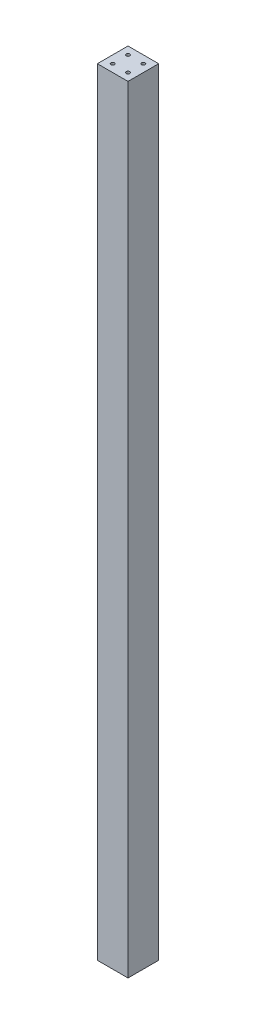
from build123d import *

# Parameters (mm, degrees)
SKETCH_1_W                  = 60
SKETCH_1_H                  = 60
EXTRUDE_1_DEPTH             = 1520
PATTERN_LINEAR_1_COUNT      = 2
PATTERN_LINEAR_1_PITCH      = 30
PATTERN_LINEAR_1_COUNT_DIR2 = 2
PATTERN_LINEAR_1_PITCH_DIR2 = 30
PATTERN_LINEAR_2_COUNT      = 2
PATTERN_LINEAR_2_PITCH      = 30
PATTERN_LINEAR_2_COUNT_DIR2 = 2
PATTERN_LINEAR_2_PITCH_DIR2 = 30


with BuildPart() as part:
    # Sketch 1 → Extrude 1 (new body)
    with BuildSketch(Plane(origin=(0, 0, 0), x_dir=(1, 0, 0), z_dir=(0, 1, 0))):
        Rectangle(SKETCH_1_W, SKETCH_1_H)
    extrude(amount=EXTRUDE_1_DEPTH)

    # Sketch 7 → Hole Wizard M8 _1 (revolve, cut)
    with BuildSketch(Plane(origin=(15, 0, -15), x_dir=(0, 0, -1), z_dir=(1, 0, 0))):
        Polygon((0, 0), (0, 19.75), (3.4, 17.707073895), (3.4, 0), align=None)
    hole_wizard_m8_1 = revolve(axis=Axis((15, -6.35, -15), (0, 1, 0)), mode=Mode.SUBTRACT)

    # Pattern Linear 1: Hole Wizard M8 _1 2 × 2
    with Locations(*[(-i * PATTERN_LINEAR_1_PITCH, 0, j * PATTERN_LINEAR_1_PITCH_DIR2) for i in range(PATTERN_LINEAR_1_COUNT) for j in range(PATTERN_LINEAR_1_COUNT_DIR2) if (i, j) != (0, 0)]):
        add(hole_wizard_m8_1, mode=Mode.SUBTRACT)

    # Sketch 10 → Hole Wizard M8 _2 (revolve, cut)
    with BuildSketch(Plane(origin=(15, 1520, -15), x_dir=(0, 0, 1), z_dir=(1, 0, 0))):
        Polygon((0, 0), (0, 19.75), (3.4, 17.707073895), (3.4, 0), align=None)
    hole_wizard_m8_2 = revolve(axis=Axis((15, 1526.35, -15), (0, -1, 0)), mode=Mode.SUBTRACT)

    # Pattern Linear 2: Hole Wizard M8 _2 2 × 2
    with Locations(*[(-i * PATTERN_LINEAR_2_PITCH, 0, j * PATTERN_LINEAR_2_PITCH_DIR2) for i in range(PATTERN_LINEAR_2_COUNT) for j in range(PATTERN_LINEAR_2_COUNT_DIR2) if (i, j) != (0, 0)]):
        add(hole_wizard_m8_2, mode=Mode.SUBTRACT)


solid = part.part
